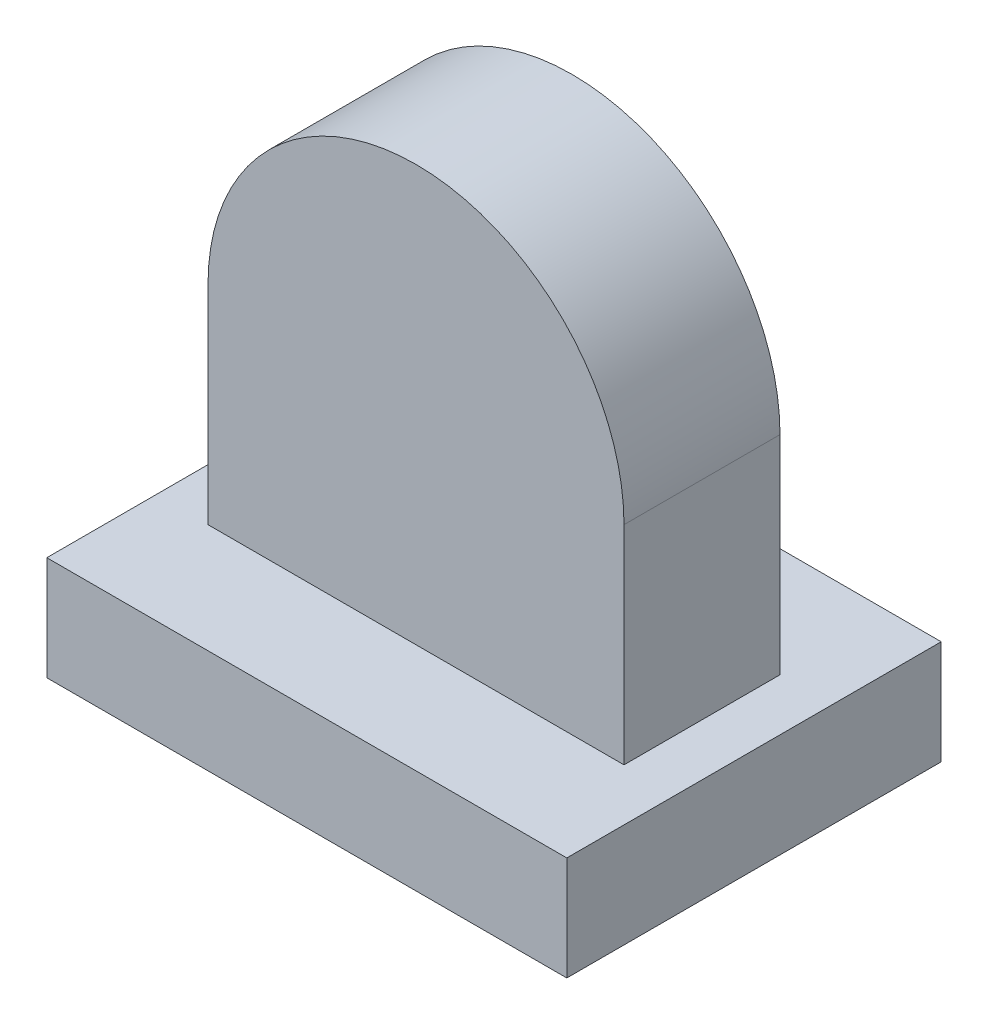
ISO-10303-21;
HEADER;
FILE_DESCRIPTION(('STEP AP214'),'2;1');
FILE_NAME('part.step','',(''),(''),'','','');
FILE_SCHEMA(('AUTOMOTIVE_DESIGN { 1 0 10303 214 1 1 1 1 }'));
ENDSEC;
DATA;
#1=APPLICATION_CONTEXT('core data for automotive mechanical design processes');
#2=APPLICATION_PROTOCOL_DEFINITION('international standard','automotive_design',2000,#1);
#3=PRODUCT_CONTEXT('',#1,'mechanical');
#4=PRODUCT('Part','Part','',(#3));
#5=PRODUCT_RELATED_PRODUCT_CATEGORY('part','',(#4));
#6=PRODUCT_DEFINITION_FORMATION('','',#4);
#7=PRODUCT_DEFINITION_CONTEXT('part definition',#1,'design');
#8=PRODUCT_DEFINITION('design','',#6,#7);
#9=PRODUCT_DEFINITION_SHAPE('','',#8);
#10=(LENGTH_UNIT() NAMED_UNIT(*) SI_UNIT(.MILLI.,.METRE.));
#11=(NAMED_UNIT(*) PLANE_ANGLE_UNIT() SI_UNIT($,.RADIAN.));
#12=(NAMED_UNIT(*) SI_UNIT($,.STERADIAN.) SOLID_ANGLE_UNIT());
#13=UNCERTAINTY_MEASURE_WITH_UNIT(LENGTH_MEASURE(1.E-05),#10,'distance_accuracy_value','');
#14=(GEOMETRIC_REPRESENTATION_CONTEXT(3) GLOBAL_UNCERTAINTY_ASSIGNED_CONTEXT((#13)) GLOBAL_UNIT_ASSIGNED_CONTEXT((#10,
#11,#12)) REPRESENTATION_CONTEXT('',''));
#15=CARTESIAN_POINT('',(0.,0.,0.));
#16=DIRECTION('',(0.,0.,1.));
#17=DIRECTION('',(1.,0.,0.));
#18=AXIS2_PLACEMENT_3D('',#15,#16,#17);
#19=CARTESIAN_POINT('',(25.,10.,-18.));
#20=DIRECTION('',(-1.,0.,0.));
#21=DIRECTION('',(0.,0.,1.));
#22=AXIS2_PLACEMENT_3D('',#19,#20,#21);
#23=PLANE('',#22);
#24=DIRECTION('',(0.,0.,-1.));
#25=VECTOR('',#24,1.);
#26=CARTESIAN_POINT('',(25.,0.,-18.));
#27=LINE('',#26,#25);
#28=CARTESIAN_POINT('',(25.,0.,18.));
#29=VERTEX_POINT('',#28);
#30=CARTESIAN_POINT('',(25.,0.,-18.));
#31=VERTEX_POINT('',#30);
#32=EDGE_CURVE('E128',#29,#31,#27,.T.);
#33=ORIENTED_EDGE('',*,*,#32,.T.);
#34=DIRECTION('',(0.,-1.,0.));
#35=VECTOR('',#34,1.);
#36=CARTESIAN_POINT('',(25.,10.,-18.));
#37=LINE('',#36,#35);
#38=CARTESIAN_POINT('',(25.,10.,-18.));
#39=VERTEX_POINT('',#38);
#40=EDGE_CURVE('E11',#39,#31,#37,.T.);
#41=ORIENTED_EDGE('',*,*,#40,.F.);
#42=DIRECTION('',(0.,0.,-1.));
#43=VECTOR('',#42,1.);
#44=CARTESIAN_POINT('',(25.,10.,-18.));
#45=LINE('',#44,#43);
#46=CARTESIAN_POINT('',(25.,10.,18.));
#47=VERTEX_POINT('',#46);
#48=EDGE_CURVE('E137',#47,#39,#45,.T.);
#49=ORIENTED_EDGE('',*,*,#48,.F.);
#50=DIRECTION('',(0.,-1.,0.));
#51=VECTOR('',#50,1.);
#52=CARTESIAN_POINT('',(25.,10.,18.));
#53=LINE('',#52,#51);
#54=EDGE_CURVE('E142',#47,#29,#53,.T.);
#55=ORIENTED_EDGE('',*,*,#54,.T.);
#56=EDGE_LOOP('',(#33,#41,#49,#55));
#57=FACE_BOUND('',#56,.T.);
#58=ADVANCED_FACE('F31',(#57),#23,.F.);
#59=CARTESIAN_POINT('',(-25.,10.,-18.));
#60=DIRECTION('',(0.,0.,1.));
#61=DIRECTION('',(1.,0.,0.));
#62=AXIS2_PLACEMENT_3D('',#59,#60,#61);
#63=PLANE('',#62);
#64=DIRECTION('',(-1.,0.,0.));
#65=VECTOR('',#64,1.);
#66=CARTESIAN_POINT('',(-25.,0.,-18.));
#67=LINE('',#66,#65);
#68=CARTESIAN_POINT('',(-25.,0.,-18.));
#69=VERTEX_POINT('',#68);
#70=EDGE_CURVE('E131',#31,#69,#67,.T.);
#71=ORIENTED_EDGE('',*,*,#70,.T.);
#72=DIRECTION('',(0.,-1.,0.));
#73=VECTOR('',#72,1.);
#74=CARTESIAN_POINT('',(-25.,10.,-18.));
#75=LINE('',#74,#73);
#76=CARTESIAN_POINT('',(-25.,10.,-18.));
#77=VERTEX_POINT('',#76);
#78=EDGE_CURVE('E38',#77,#69,#75,.T.);
#79=ORIENTED_EDGE('',*,*,#78,.F.);
#80=DIRECTION('',(-1.,0.,0.));
#81=VECTOR('',#80,1.);
#82=CARTESIAN_POINT('',(-25.,10.,-18.));
#83=LINE('',#82,#81);
#84=EDGE_CURVE('E82',#39,#77,#83,.T.);
#85=ORIENTED_EDGE('',*,*,#84,.F.);
#86=ORIENTED_EDGE('',*,*,#40,.T.);
#87=EDGE_LOOP('',(#71,#79,#85,#86));
#88=FACE_BOUND('',#87,.T.);
#89=ADVANCED_FACE('F172',(#88),#63,.F.);
#90=CARTESIAN_POINT('',(-25.,10.,-18.));
#91=DIRECTION('',(1.,0.,0.));
#92=DIRECTION('',(0.,0.,-1.));
#93=AXIS2_PLACEMENT_3D('',#90,#91,#92);
#94=PLANE('',#93);
#95=DIRECTION('',(0.,0.,1.));
#96=VECTOR('',#95,1.);
#97=CARTESIAN_POINT('',(-25.,0.,-18.));
#98=LINE('',#97,#96);
#99=CARTESIAN_POINT('',(-25.,0.,18.));
#100=VERTEX_POINT('',#99);
#101=EDGE_CURVE('E145',#69,#100,#98,.T.);
#102=ORIENTED_EDGE('',*,*,#101,.T.);
#103=DIRECTION('',(0.,-1.,0.));
#104=VECTOR('',#103,1.);
#105=CARTESIAN_POINT('',(-25.,10.,18.));
#106=LINE('',#105,#104);
#107=CARTESIAN_POINT('',(-25.,10.,18.));
#108=VERTEX_POINT('',#107);
#109=EDGE_CURVE('E149',#108,#100,#106,.T.);
#110=ORIENTED_EDGE('',*,*,#109,.F.);
#111=DIRECTION('',(0.,0.,1.));
#112=VECTOR('',#111,1.);
#113=CARTESIAN_POINT('',(-25.,10.,-18.));
#114=LINE('',#113,#112);
#115=EDGE_CURVE('E140',#77,#108,#114,.T.);
#116=ORIENTED_EDGE('',*,*,#115,.F.);
#117=ORIENTED_EDGE('',*,*,#78,.T.);
#118=EDGE_LOOP('',(#102,#110,#116,#117));
#119=FACE_BOUND('',#118,.T.);
#120=ADVANCED_FACE('F154',(#119),#94,.F.);
#121=CARTESIAN_POINT('',(-25.,10.,18.));
#122=DIRECTION('',(0.,0.,-1.));
#123=DIRECTION('',(-1.,0.,0.));
#124=AXIS2_PLACEMENT_3D('',#121,#122,#123);
#125=PLANE('',#124);
#126=DIRECTION('',(1.,0.,0.));
#127=VECTOR('',#126,1.);
#128=CARTESIAN_POINT('',(-25.,0.,18.));
#129=LINE('',#128,#127);
#130=EDGE_CURVE('E75',#100,#29,#129,.T.);
#131=ORIENTED_EDGE('',*,*,#130,.T.);
#132=ORIENTED_EDGE('',*,*,#54,.F.);
#133=DIRECTION('',(1.,0.,0.));
#134=VECTOR('',#133,1.);
#135=CARTESIAN_POINT('',(-25.,10.,18.));
#136=LINE('',#135,#134);
#137=EDGE_CURVE('E54',#108,#47,#136,.T.);
#138=ORIENTED_EDGE('',*,*,#137,.F.);
#139=ORIENTED_EDGE('',*,*,#109,.T.);
#140=EDGE_LOOP('',(#131,#132,#138,#139));
#141=FACE_BOUND('',#140,.T.);
#142=ADVANCED_FACE('F162',(#141),#125,.F.);
#143=CARTESIAN_POINT('',(25.,10.,18.));
#144=DIRECTION('',(0.,1.,0.));
#145=DIRECTION('',(0.,0.,1.));
#146=AXIS2_PLACEMENT_3D('',#143,#144,#145);
#147=PLANE('',#146);
#148=DIRECTION('',(1.,0.,0.));
#149=VECTOR('',#148,1.);
#150=CARTESIAN_POINT('',(-20.,10.,7.5));
#151=LINE('',#150,#149);
#152=CARTESIAN_POINT('',(-20.,10.,7.5));
#153=VERTEX_POINT('',#152);
#154=CARTESIAN_POINT('',(20.,10.,7.5));
#155=VERTEX_POINT('',#154);
#156=EDGE_CURVE('E115',#153,#155,#151,.T.);
#157=ORIENTED_EDGE('',*,*,#156,.F.);
#158=DIRECTION('',(0.,0.,-1.));
#159=VECTOR('',#158,1.);
#160=CARTESIAN_POINT('',(-20.,10.,7.5));
#161=LINE('',#160,#159);
#162=CARTESIAN_POINT('',(-20.,10.,-7.5));
#163=VERTEX_POINT('',#162);
#164=EDGE_CURVE('E112',#153,#163,#161,.T.);
#165=ORIENTED_EDGE('',*,*,#164,.T.);
#166=DIRECTION('',(1.,0.,0.));
#167=VECTOR('',#166,1.);
#168=CARTESIAN_POINT('',(-20.,10.,-7.5));
#169=LINE('',#168,#167);
#170=CARTESIAN_POINT('',(20.,10.,-7.5));
#171=VERTEX_POINT('',#170);
#172=EDGE_CURVE('E251',#163,#171,#169,.T.);
#173=ORIENTED_EDGE('',*,*,#172,.T.);
#174=DIRECTION('',(0.,0.,-1.));
#175=VECTOR('',#174,1.);
#176=CARTESIAN_POINT('',(20.,10.,7.5));
#177=LINE('',#176,#175);
#178=EDGE_CURVE('E133',#155,#171,#177,.T.);
#179=ORIENTED_EDGE('',*,*,#178,.F.);
#180=EDGE_LOOP('',(#157,#165,#173,#179));
#181=FACE_BOUND('',#180,.T.);
#182=ORIENTED_EDGE('',*,*,#48,.T.);
#183=ORIENTED_EDGE('',*,*,#84,.T.);
#184=ORIENTED_EDGE('',*,*,#115,.T.);
#185=ORIENTED_EDGE('',*,*,#137,.T.);
#186=EDGE_LOOP('',(#182,#183,#184,#185));
#187=FACE_BOUND('',#186,.T.);
#188=ADVANCED_FACE('F164',(#181,#187),#147,.T.);
#189=CARTESIAN_POINT('',(25.,0.,18.));
#190=DIRECTION('',(0.,1.,0.));
#191=DIRECTION('',(0.,0.,1.));
#192=AXIS2_PLACEMENT_3D('',#189,#190,#191);
#193=PLANE('',#192);
#194=ORIENTED_EDGE('',*,*,#32,.F.);
#195=ORIENTED_EDGE('',*,*,#130,.F.);
#196=ORIENTED_EDGE('',*,*,#101,.F.);
#197=ORIENTED_EDGE('',*,*,#70,.F.);
#198=EDGE_LOOP('',(#194,#195,#196,#197));
#199=FACE_BOUND('',#198,.T.);
#200=ADVANCED_FACE('F158',(#199),#193,.F.);
#201=CARTESIAN_POINT('',(0.,30.,7.5));
#202=DIRECTION('',(0.,0.,-1.));
#203=DIRECTION('',(-1.,0.,0.));
#204=AXIS2_PLACEMENT_3D('',#201,#202,#203);
#205=CYLINDRICAL_SURFACE('',#204,20.);
#206=CARTESIAN_POINT('',(0.,30.,-7.5));
#207=DIRECTION('',(0.,0.,1.));
#208=DIRECTION('',(1.,0.,0.));
#209=AXIS2_PLACEMENT_3D('',#206,#207,#208);
#210=CIRCLE('',#209,20.);
#211=CARTESIAN_POINT('',(20.,30.,-7.5));
#212=VERTEX_POINT('',#211);
#213=CARTESIAN_POINT('',(-20.,30.,-7.5));
#214=VERTEX_POINT('',#213);
#215=EDGE_CURVE('E127',#212,#214,#210,.T.);
#216=ORIENTED_EDGE('',*,*,#215,.T.);
#217=DIRECTION('',(0.,0.,-1.));
#218=VECTOR('',#217,1.);
#219=CARTESIAN_POINT('',(-20.,30.,7.5));
#220=LINE('',#219,#218);
#221=CARTESIAN_POINT('',(-20.,30.,7.5));
#222=VERTEX_POINT('',#221);
#223=EDGE_CURVE('E109',#222,#214,#220,.T.);
#224=ORIENTED_EDGE('',*,*,#223,.F.);
#225=CARTESIAN_POINT('',(0.,30.,7.5));
#226=DIRECTION('',(0.,0.,1.));
#227=DIRECTION('',(1.,0.,0.));
#228=AXIS2_PLACEMENT_3D('',#225,#226,#227);
#229=CIRCLE('',#228,20.);
#230=CARTESIAN_POINT('',(20.,30.,7.5));
#231=VERTEX_POINT('',#230);
#232=EDGE_CURVE('E116',#231,#222,#229,.T.);
#233=ORIENTED_EDGE('',*,*,#232,.F.);
#234=DIRECTION('',(0.,0.,-1.));
#235=VECTOR('',#234,1.);
#236=CARTESIAN_POINT('',(20.,30.,7.5));
#237=LINE('',#236,#235);
#238=EDGE_CURVE('E259',#231,#212,#237,.T.);
#239=ORIENTED_EDGE('',*,*,#238,.T.);
#240=EDGE_LOOP('',(#216,#224,#233,#239));
#241=FACE_BOUND('',#240,.T.);
#242=ADVANCED_FACE('F126',(#241),#205,.T.);
#243=CARTESIAN_POINT('',(-20.,30.,7.5));
#244=DIRECTION('',(1.,0.,0.));
#245=DIRECTION('',(0.,1.,0.));
#246=AXIS2_PLACEMENT_3D('',#243,#244,#245);
#247=PLANE('',#246);
#248=DIRECTION('',(0.,-1.,0.));
#249=VECTOR('',#248,1.);
#250=CARTESIAN_POINT('',(-20.,30.,-7.5));
#251=LINE('',#250,#249);
#252=EDGE_CURVE('E249',#214,#163,#251,.T.);
#253=ORIENTED_EDGE('',*,*,#252,.T.);
#254=ORIENTED_EDGE('',*,*,#164,.F.);
#255=DIRECTION('',(0.,-1.,0.));
#256=VECTOR('',#255,1.);
#257=CARTESIAN_POINT('',(-20.,30.,7.5));
#258=LINE('',#257,#256);
#259=EDGE_CURVE('E105',#222,#153,#258,.T.);
#260=ORIENTED_EDGE('',*,*,#259,.F.);
#261=ORIENTED_EDGE('',*,*,#223,.T.);
#262=EDGE_LOOP('',(#253,#254,#260,#261));
#263=FACE_BOUND('',#262,.T.);
#264=ADVANCED_FACE('F107',(#263),#247,.F.);
#265=CARTESIAN_POINT('',(20.,30.,7.5));
#266=DIRECTION('',(-1.,0.,0.));
#267=DIRECTION('',(0.,-1.,0.));
#268=AXIS2_PLACEMENT_3D('',#265,#266,#267);
#269=PLANE('',#268);
#270=DIRECTION('',(0.,1.,0.));
#271=VECTOR('',#270,1.);
#272=CARTESIAN_POINT('',(20.,30.,-7.5));
#273=LINE('',#272,#271);
#274=EDGE_CURVE('E45',#171,#212,#273,.T.);
#275=ORIENTED_EDGE('',*,*,#274,.T.);
#276=ORIENTED_EDGE('',*,*,#238,.F.);
#277=DIRECTION('',(0.,1.,0.));
#278=VECTOR('',#277,1.);
#279=CARTESIAN_POINT('',(20.,30.,7.5));
#280=LINE('',#279,#278);
#281=EDGE_CURVE('E121',#155,#231,#280,.T.);
#282=ORIENTED_EDGE('',*,*,#281,.F.);
#283=ORIENTED_EDGE('',*,*,#178,.T.);
#284=EDGE_LOOP('',(#275,#276,#282,#283));
#285=FACE_BOUND('',#284,.T.);
#286=ADVANCED_FACE('F219',(#285),#269,.F.);
#287=CARTESIAN_POINT('',(0.,30.,7.5));
#288=DIRECTION('',(0.,0.,1.));
#289=DIRECTION('',(1.,0.,0.));
#290=AXIS2_PLACEMENT_3D('',#287,#288,#289);
#291=PLANE('',#290);
#292=ORIENTED_EDGE('',*,*,#232,.T.);
#293=ORIENTED_EDGE('',*,*,#259,.T.);
#294=ORIENTED_EDGE('',*,*,#156,.T.);
#295=ORIENTED_EDGE('',*,*,#281,.T.);
#296=EDGE_LOOP('',(#292,#293,#294,#295));
#297=FACE_BOUND('',#296,.T.);
#298=ADVANCED_FACE('F119',(#297),#291,.T.);
#299=CARTESIAN_POINT('',(0.,30.,-7.5));
#300=DIRECTION('',(0.,0.,1.));
#301=DIRECTION('',(1.,0.,0.));
#302=AXIS2_PLACEMENT_3D('',#299,#300,#301);
#303=PLANE('',#302);
#304=ORIENTED_EDGE('',*,*,#215,.F.);
#305=ORIENTED_EDGE('',*,*,#274,.F.);
#306=ORIENTED_EDGE('',*,*,#172,.F.);
#307=ORIENTED_EDGE('',*,*,#252,.F.);
#308=EDGE_LOOP('',(#304,#305,#306,#307));
#309=FACE_BOUND('',#308,.T.);
#310=ADVANCED_FACE('F237',(#309),#303,.F.);
#311=CLOSED_SHELL('',(#58,#89,#120,#142,#188,#200,#242,#264,#286,#298,#310));
#312=MANIFOLD_SOLID_BREP('B2',#311);
#313=ADVANCED_BREP_SHAPE_REPRESENTATION('',(#18,#312),#14);
#314=SHAPE_DEFINITION_REPRESENTATION(#9,#313);
ENDSEC;
END-ISO-10303-21;
